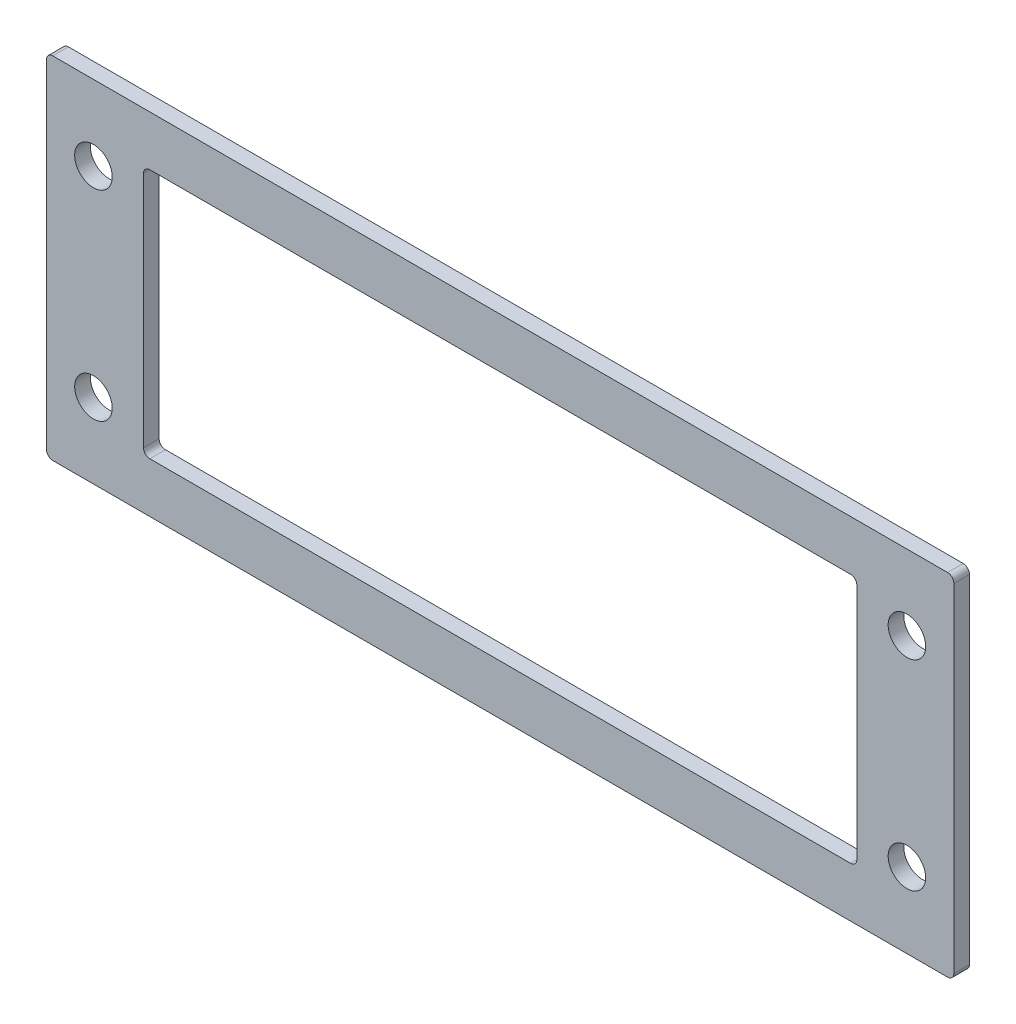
ISO-10303-21;
HEADER;
FILE_DESCRIPTION(('STEP AP214'),'2;1');
FILE_NAME('part.step','',(''),(''),'','','');
FILE_SCHEMA(('AUTOMOTIVE_DESIGN { 1 0 10303 214 1 1 1 1 }'));
ENDSEC;
DATA;
#1=APPLICATION_CONTEXT('core data for automotive mechanical design processes');
#2=APPLICATION_PROTOCOL_DEFINITION('international standard','automotive_design',2000,#1);
#3=PRODUCT_CONTEXT('',#1,'mechanical');
#4=PRODUCT('Part','Part','',(#3));
#5=PRODUCT_RELATED_PRODUCT_CATEGORY('part','',(#4));
#6=PRODUCT_DEFINITION_FORMATION('','',#4);
#7=PRODUCT_DEFINITION_CONTEXT('part definition',#1,'design');
#8=PRODUCT_DEFINITION('design','',#6,#7);
#9=PRODUCT_DEFINITION_SHAPE('','',#8);
#10=(LENGTH_UNIT() NAMED_UNIT(*) SI_UNIT(.MILLI.,.METRE.));
#11=(NAMED_UNIT(*) PLANE_ANGLE_UNIT() SI_UNIT($,.RADIAN.));
#12=(NAMED_UNIT(*) SI_UNIT($,.STERADIAN.) SOLID_ANGLE_UNIT());
#13=UNCERTAINTY_MEASURE_WITH_UNIT(LENGTH_MEASURE(1.E-05),#10,'distance_accuracy_value','');
#14=(GEOMETRIC_REPRESENTATION_CONTEXT(3) GLOBAL_UNCERTAINTY_ASSIGNED_CONTEXT((#13)) GLOBAL_UNIT_ASSIGNED_CONTEXT((#10,
#11,#12)) REPRESENTATION_CONTEXT('',''));
#15=CARTESIAN_POINT('',(0.,0.,0.));
#16=DIRECTION('',(0.,0.,1.));
#17=DIRECTION('',(1.,0.,0.));
#18=AXIS2_PLACEMENT_3D('',#15,#16,#17);
#19=CARTESIAN_POINT('',(-65.,16.,8.56471862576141));
#20=DIRECTION('',(0.,0.,1.));
#21=DIRECTION('',(1.,0.,0.));
#22=AXIS2_PLACEMENT_3D('',#19,#20,#21);
#23=CYLINDRICAL_SURFACE('',#22,3.);
#24=CARTESIAN_POINT('',(-65.,16.,17.05));
#25=DIRECTION('',(0.,0.,1.));
#26=DIRECTION('',(1.,0.,0.));
#27=AXIS2_PLACEMENT_3D('',#24,#25,#26);
#28=CIRCLE('',#27,3.);
#29=CARTESIAN_POINT('',(-62.,16.,17.05));
#30=VERTEX_POINT('',#29);
#31=EDGE_CURVE('E324',#30,#30,#28,.T.);
#32=ORIENTED_EDGE('',*,*,#31,.F.);
#33=EDGE_LOOP('',(#32));
#34=FACE_BOUND('',#33,.T.);
#35=CARTESIAN_POINT('',(-65.,16.,19.55));
#36=DIRECTION('',(0.,0.,-1.));
#37=DIRECTION('',(-1.,0.,0.));
#38=AXIS2_PLACEMENT_3D('',#35,#36,#37);
#39=CIRCLE('',#38,3.);
#40=CARTESIAN_POINT('',(-68.,16.,19.55));
#41=VERTEX_POINT('',#40);
#42=EDGE_CURVE('E35',#41,#41,#39,.T.);
#43=ORIENTED_EDGE('',*,*,#42,.F.);
#44=EDGE_LOOP('',(#43));
#45=FACE_BOUND('',#44,.T.);
#46=ADVANCED_FACE('F15',(#34,#45),#23,.F.);
#47=CARTESIAN_POINT('',(65.,16.,8.56471862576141));
#48=DIRECTION('',(0.,0.,1.));
#49=DIRECTION('',(1.,0.,0.));
#50=AXIS2_PLACEMENT_3D('',#47,#48,#49);
#51=CYLINDRICAL_SURFACE('',#50,3.);
#52=CARTESIAN_POINT('',(65.,16.,17.05));
#53=DIRECTION('',(0.,0.,1.));
#54=DIRECTION('',(1.,0.,0.));
#55=AXIS2_PLACEMENT_3D('',#52,#53,#54);
#56=CIRCLE('',#55,3.);
#57=CARTESIAN_POINT('',(68.,16.,17.05));
#58=VERTEX_POINT('',#57);
#59=EDGE_CURVE('E321',#58,#58,#56,.T.);
#60=ORIENTED_EDGE('',*,*,#59,.F.);
#61=EDGE_LOOP('',(#60));
#62=FACE_BOUND('',#61,.T.);
#63=CARTESIAN_POINT('',(65.,16.,19.55));
#64=DIRECTION('',(0.,0.,-1.));
#65=DIRECTION('',(-1.,0.,0.));
#66=AXIS2_PLACEMENT_3D('',#63,#64,#65);
#67=CIRCLE('',#66,3.);
#68=CARTESIAN_POINT('',(62.,16.,19.55));
#69=VERTEX_POINT('',#68);
#70=EDGE_CURVE('E360',#69,#69,#67,.T.);
#71=ORIENTED_EDGE('',*,*,#70,.F.);
#72=EDGE_LOOP('',(#71));
#73=FACE_BOUND('',#72,.T.);
#74=ADVANCED_FACE('F413',(#62,#73),#51,.F.);
#75=CARTESIAN_POINT('',(-71.5,27.,17.05));
#76=DIRECTION('',(0.,0.,1.));
#77=DIRECTION('',(1.,0.,0.));
#78=AXIS2_PLACEMENT_3D('',#75,#76,#77);
#79=CYLINDRICAL_SURFACE('',#78,1.);
#80=CARTESIAN_POINT('',(-71.5,27.,17.05));
#81=DIRECTION('',(0.,0.,-1.));
#82=DIRECTION('',(1.,0.,0.));
#83=AXIS2_PLACEMENT_3D('',#80,#81,#82);
#84=CIRCLE('',#83,1.);
#85=CARTESIAN_POINT('',(-72.5,27.,17.05));
#86=VERTEX_POINT('',#85);
#87=CARTESIAN_POINT('',(-71.5,28.,17.05));
#88=VERTEX_POINT('',#87);
#89=EDGE_CURVE('E276',#86,#88,#84,.T.);
#90=ORIENTED_EDGE('',*,*,#89,.F.);
#91=DIRECTION('',(0.,0.,-1.));
#92=VECTOR('',#91,1.);
#93=CARTESIAN_POINT('',(-72.5,27.,17.05));
#94=LINE('',#93,#92);
#95=CARTESIAN_POINT('',(-72.5,27.,19.55));
#96=VERTEX_POINT('',#95);
#97=EDGE_CURVE('E241',#96,#86,#94,.T.);
#98=ORIENTED_EDGE('',*,*,#97,.F.);
#99=CARTESIAN_POINT('',(-71.5,27.,19.55));
#100=DIRECTION('',(0.,0.,1.));
#101=DIRECTION('',(1.,0.,0.));
#102=AXIS2_PLACEMENT_3D('',#99,#100,#101);
#103=CIRCLE('',#102,1.);
#104=CARTESIAN_POINT('',(-71.5,28.,19.55));
#105=VERTEX_POINT('',#104);
#106=EDGE_CURVE('E343',#105,#96,#103,.T.);
#107=ORIENTED_EDGE('',*,*,#106,.F.);
#108=DIRECTION('',(0.,0.,1.));
#109=VECTOR('',#108,1.);
#110=CARTESIAN_POINT('',(-71.5,28.,17.05));
#111=LINE('',#110,#109);
#112=EDGE_CURVE('E247',#88,#105,#111,.T.);
#113=ORIENTED_EDGE('',*,*,#112,.F.);
#114=EDGE_LOOP('',(#90,#98,#107,#113));
#115=FACE_BOUND('',#114,.T.);
#116=ADVANCED_FACE('F418',(#115),#79,.T.);
#117=CARTESIAN_POINT('',(-71.5,-27.,17.05));
#118=DIRECTION('',(0.,0.,1.));
#119=DIRECTION('',(1.,0.,0.));
#120=AXIS2_PLACEMENT_3D('',#117,#118,#119);
#121=CYLINDRICAL_SURFACE('',#120,1.);
#122=CARTESIAN_POINT('',(-71.5,-27.,17.05));
#123=DIRECTION('',(0.,0.,-1.));
#124=DIRECTION('',(1.,0.,0.));
#125=AXIS2_PLACEMENT_3D('',#122,#123,#124);
#126=CIRCLE('',#125,1.);
#127=CARTESIAN_POINT('',(-71.5,-28.,17.05));
#128=VERTEX_POINT('',#127);
#129=CARTESIAN_POINT('',(-72.5,-27.,17.05));
#130=VERTEX_POINT('',#129);
#131=EDGE_CURVE('E291',#128,#130,#126,.T.);
#132=ORIENTED_EDGE('',*,*,#131,.F.);
#133=DIRECTION('',(0.,0.,-1.));
#134=VECTOR('',#133,1.);
#135=CARTESIAN_POINT('',(-71.5,-28.,17.05));
#136=LINE('',#135,#134);
#137=CARTESIAN_POINT('',(-71.5,-28.,19.55));
#138=VERTEX_POINT('',#137);
#139=EDGE_CURVE('E235',#138,#128,#136,.T.);
#140=ORIENTED_EDGE('',*,*,#139,.F.);
#141=CARTESIAN_POINT('',(-71.5,-27.,19.55));
#142=DIRECTION('',(0.,0.,1.));
#143=DIRECTION('',(1.,0.,0.));
#144=AXIS2_PLACEMENT_3D('',#141,#142,#143);
#145=CIRCLE('',#144,1.);
#146=CARTESIAN_POINT('',(-72.5,-27.,19.55));
#147=VERTEX_POINT('',#146);
#148=EDGE_CURVE('E348',#147,#138,#145,.T.);
#149=ORIENTED_EDGE('',*,*,#148,.F.);
#150=DIRECTION('',(0.,0.,1.));
#151=VECTOR('',#150,1.);
#152=CARTESIAN_POINT('',(-72.5,-27.,17.05));
#153=LINE('',#152,#151);
#154=EDGE_CURVE('E238',#130,#147,#153,.T.);
#155=ORIENTED_EDGE('',*,*,#154,.F.);
#156=EDGE_LOOP('',(#132,#140,#149,#155));
#157=FACE_BOUND('',#156,.T.);
#158=ADVANCED_FACE('F495',(#157),#121,.T.);
#159=CARTESIAN_POINT('',(71.5,-27.,17.05));
#160=DIRECTION('',(0.,0.,1.));
#161=DIRECTION('',(1.,0.,0.));
#162=AXIS2_PLACEMENT_3D('',#159,#160,#161);
#163=CYLINDRICAL_SURFACE('',#162,1.);
#164=CARTESIAN_POINT('',(71.5,-27.,17.05));
#165=DIRECTION('',(0.,0.,-1.));
#166=DIRECTION('',(1.,0.,0.));
#167=AXIS2_PLACEMENT_3D('',#164,#165,#166);
#168=CIRCLE('',#167,1.);
#169=CARTESIAN_POINT('',(72.5,-27.,17.05));
#170=VERTEX_POINT('',#169);
#171=CARTESIAN_POINT('',(71.5,-28.,17.05));
#172=VERTEX_POINT('',#171);
#173=EDGE_CURVE('E287',#170,#172,#168,.T.);
#174=ORIENTED_EDGE('',*,*,#173,.F.);
#175=DIRECTION('',(0.,0.,-1.));
#176=VECTOR('',#175,1.);
#177=CARTESIAN_POINT('',(72.5,-27.,17.05));
#178=LINE('',#177,#176);
#179=CARTESIAN_POINT('',(72.5,-27.,19.55));
#180=VERTEX_POINT('',#179);
#181=EDGE_CURVE('E229',#180,#170,#178,.T.);
#182=ORIENTED_EDGE('',*,*,#181,.F.);
#183=CARTESIAN_POINT('',(71.5,-27.,19.55));
#184=DIRECTION('',(0.,0.,1.));
#185=DIRECTION('',(1.,0.,0.));
#186=AXIS2_PLACEMENT_3D('',#183,#184,#185);
#187=CIRCLE('',#186,1.);
#188=CARTESIAN_POINT('',(71.5,-28.,19.55));
#189=VERTEX_POINT('',#188);
#190=EDGE_CURVE('E356',#189,#180,#187,.T.);
#191=ORIENTED_EDGE('',*,*,#190,.F.);
#192=DIRECTION('',(0.,0.,1.));
#193=VECTOR('',#192,1.);
#194=CARTESIAN_POINT('',(71.5,-28.,17.05));
#195=LINE('',#194,#193);
#196=EDGE_CURVE('E232',#172,#189,#195,.T.);
#197=ORIENTED_EDGE('',*,*,#196,.F.);
#198=EDGE_LOOP('',(#174,#182,#191,#197));
#199=FACE_BOUND('',#198,.T.);
#200=ADVANCED_FACE('F499',(#199),#163,.T.);
#201=CARTESIAN_POINT('',(71.5,27.,17.05));
#202=DIRECTION('',(0.,0.,1.));
#203=DIRECTION('',(1.,0.,0.));
#204=AXIS2_PLACEMENT_3D('',#201,#202,#203);
#205=CYLINDRICAL_SURFACE('',#204,1.);
#206=CARTESIAN_POINT('',(71.5,27.,17.05));
#207=DIRECTION('',(0.,0.,-1.));
#208=DIRECTION('',(1.,0.,0.));
#209=AXIS2_PLACEMENT_3D('',#206,#207,#208);
#210=CIRCLE('',#209,1.);
#211=CARTESIAN_POINT('',(71.5,28.,17.05));
#212=VERTEX_POINT('',#211);
#213=CARTESIAN_POINT('',(72.5,27.,17.05));
#214=VERTEX_POINT('',#213);
#215=EDGE_CURVE('E456',#212,#214,#210,.T.);
#216=ORIENTED_EDGE('',*,*,#215,.F.);
#217=DIRECTION('',(0.,0.,-1.));
#218=VECTOR('',#217,1.);
#219=CARTESIAN_POINT('',(71.5,28.,17.05));
#220=LINE('',#219,#218);
#221=CARTESIAN_POINT('',(71.5,28.,19.55));
#222=VERTEX_POINT('',#221);
#223=EDGE_CURVE('E244',#222,#212,#220,.T.);
#224=ORIENTED_EDGE('',*,*,#223,.F.);
#225=CARTESIAN_POINT('',(71.5,27.,19.55));
#226=DIRECTION('',(0.,0.,1.));
#227=DIRECTION('',(1.,0.,0.));
#228=AXIS2_PLACEMENT_3D('',#225,#226,#227);
#229=CIRCLE('',#228,1.);
#230=CARTESIAN_POINT('',(72.5,27.,19.55));
#231=VERTEX_POINT('',#230);
#232=EDGE_CURVE('E333',#231,#222,#229,.T.);
#233=ORIENTED_EDGE('',*,*,#232,.F.);
#234=DIRECTION('',(0.,0.,1.));
#235=VECTOR('',#234,1.);
#236=CARTESIAN_POINT('',(72.5,27.,17.05));
#237=LINE('',#236,#235);
#238=EDGE_CURVE('E226',#214,#231,#237,.T.);
#239=ORIENTED_EDGE('',*,*,#238,.F.);
#240=EDGE_LOOP('',(#216,#224,#233,#239));
#241=FACE_BOUND('',#240,.T.);
#242=ADVANCED_FACE('F455',(#241),#205,.T.);
#243=CARTESIAN_POINT('',(56.,-19.,-103.763906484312));
#244=DIRECTION('',(0.,0.,-1.));
#245=DIRECTION('',(-1.,0.,0.));
#246=AXIS2_PLACEMENT_3D('',#243,#244,#245);
#247=CYLINDRICAL_SURFACE('',#246,1.);
#248=CARTESIAN_POINT('',(56.,-19.,17.05));
#249=DIRECTION('',(0.,0.,1.));
#250=DIRECTION('',(1.,0.,0.));
#251=AXIS2_PLACEMENT_3D('',#248,#249,#250);
#252=CIRCLE('',#251,1.);
#253=CARTESIAN_POINT('',(56.,-20.,17.05));
#254=VERTEX_POINT('',#253);
#255=CARTESIAN_POINT('',(57.,-19.,17.05));
#256=VERTEX_POINT('',#255);
#257=EDGE_CURVE('E274',#254,#256,#252,.T.);
#258=ORIENTED_EDGE('',*,*,#257,.F.);
#259=DIRECTION('',(0.,0.,-1.));
#260=VECTOR('',#259,1.);
#261=CARTESIAN_POINT('',(56.,-20.,17.05));
#262=LINE('',#261,#260);
#263=CARTESIAN_POINT('',(56.,-20.,19.55));
#264=VERTEX_POINT('',#263);
#265=EDGE_CURVE('E205',#264,#254,#262,.T.);
#266=ORIENTED_EDGE('',*,*,#265,.F.);
#267=CARTESIAN_POINT('',(56.,-19.,19.55));
#268=DIRECTION('',(0.,0.,-1.));
#269=DIRECTION('',(1.,0.,0.));
#270=AXIS2_PLACEMENT_3D('',#267,#268,#269);
#271=CIRCLE('',#270,1.);
#272=CARTESIAN_POINT('',(57.,-19.,19.55));
#273=VERTEX_POINT('',#272);
#274=EDGE_CURVE('E203',#273,#264,#271,.T.);
#275=ORIENTED_EDGE('',*,*,#274,.F.);
#276=DIRECTION('',(0.,0.,1.));
#277=VECTOR('',#276,1.);
#278=CARTESIAN_POINT('',(57.,-19.,19.55));
#279=LINE('',#278,#277);
#280=EDGE_CURVE('E10',#256,#273,#279,.T.);
#281=ORIENTED_EDGE('',*,*,#280,.F.);
#282=EDGE_LOOP('',(#258,#266,#275,#281));
#283=FACE_BOUND('',#282,.T.);
#284=ADVANCED_FACE('F204',(#283),#247,.F.);
#285=CARTESIAN_POINT('',(56.,19.,-103.763906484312));
#286=DIRECTION('',(0.,0.,-1.));
#287=DIRECTION('',(-1.,0.,0.));
#288=AXIS2_PLACEMENT_3D('',#285,#286,#287);
#289=CYLINDRICAL_SURFACE('',#288,1.);
#290=CARTESIAN_POINT('',(56.,19.,17.05));
#291=DIRECTION('',(0.,0.,1.));
#292=DIRECTION('',(1.,0.,0.));
#293=AXIS2_PLACEMENT_3D('',#290,#291,#292);
#294=CIRCLE('',#293,1.);
#295=CARTESIAN_POINT('',(57.,19.,17.05));
#296=VERTEX_POINT('',#295);
#297=CARTESIAN_POINT('',(56.,20.,17.05));
#298=VERTEX_POINT('',#297);
#299=EDGE_CURVE('E263',#296,#298,#294,.T.);
#300=ORIENTED_EDGE('',*,*,#299,.F.);
#301=DIRECTION('',(0.,0.,-1.));
#302=VECTOR('',#301,1.);
#303=CARTESIAN_POINT('',(57.,19.,17.05));
#304=LINE('',#303,#302);
#305=CARTESIAN_POINT('',(57.,19.,19.55));
#306=VERTEX_POINT('',#305);
#307=EDGE_CURVE('E24',#306,#296,#304,.T.);
#308=ORIENTED_EDGE('',*,*,#307,.F.);
#309=CARTESIAN_POINT('',(56.,19.,19.55));
#310=DIRECTION('',(0.,0.,-1.));
#311=DIRECTION('',(1.,0.,0.));
#312=AXIS2_PLACEMENT_3D('',#309,#310,#311);
#313=CIRCLE('',#312,1.);
#314=CARTESIAN_POINT('',(56.,20.,19.55));
#315=VERTEX_POINT('',#314);
#316=EDGE_CURVE('E215',#315,#306,#313,.T.);
#317=ORIENTED_EDGE('',*,*,#316,.F.);
#318=DIRECTION('',(0.,0.,1.));
#319=VECTOR('',#318,1.);
#320=CARTESIAN_POINT('',(56.,20.,19.55));
#321=LINE('',#320,#319);
#322=EDGE_CURVE('E255',#298,#315,#321,.T.);
#323=ORIENTED_EDGE('',*,*,#322,.F.);
#324=EDGE_LOOP('',(#300,#308,#317,#323));
#325=FACE_BOUND('',#324,.T.);
#326=ADVANCED_FACE('F264',(#325),#289,.F.);
#327=CARTESIAN_POINT('',(-56.,19.,-103.763906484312));
#328=DIRECTION('',(0.,0.,-1.));
#329=DIRECTION('',(-1.,0.,0.));
#330=AXIS2_PLACEMENT_3D('',#327,#328,#329);
#331=CYLINDRICAL_SURFACE('',#330,1.);
#332=CARTESIAN_POINT('',(-56.,19.,17.05));
#333=DIRECTION('',(0.,0.,1.));
#334=DIRECTION('',(1.,0.,0.));
#335=AXIS2_PLACEMENT_3D('',#332,#333,#334);
#336=CIRCLE('',#335,1.);
#337=CARTESIAN_POINT('',(-56.,20.,17.05));
#338=VERTEX_POINT('',#337);
#339=CARTESIAN_POINT('',(-57.,19.,17.05));
#340=VERTEX_POINT('',#339);
#341=EDGE_CURVE('E304',#338,#340,#336,.T.);
#342=ORIENTED_EDGE('',*,*,#341,.F.);
#343=DIRECTION('',(0.,0.,-1.));
#344=VECTOR('',#343,1.);
#345=CARTESIAN_POINT('',(-56.,20.,17.05));
#346=LINE('',#345,#344);
#347=CARTESIAN_POINT('',(-56.,20.,19.55));
#348=VERTEX_POINT('',#347);
#349=EDGE_CURVE('E250',#348,#338,#346,.T.);
#350=ORIENTED_EDGE('',*,*,#349,.F.);
#351=CARTESIAN_POINT('',(-56.,19.,19.55));
#352=DIRECTION('',(0.,0.,-1.));
#353=DIRECTION('',(1.,0.,0.));
#354=AXIS2_PLACEMENT_3D('',#351,#352,#353);
#355=CIRCLE('',#354,1.);
#356=CARTESIAN_POINT('',(-57.,19.,19.55));
#357=VERTEX_POINT('',#356);
#358=EDGE_CURVE('E377',#357,#348,#355,.T.);
#359=ORIENTED_EDGE('',*,*,#358,.F.);
#360=DIRECTION('',(0.,0.,1.));
#361=VECTOR('',#360,1.);
#362=CARTESIAN_POINT('',(-57.,19.,19.55));
#363=LINE('',#362,#361);
#364=EDGE_CURVE('E254',#340,#357,#363,.T.);
#365=ORIENTED_EDGE('',*,*,#364,.F.);
#366=EDGE_LOOP('',(#342,#350,#359,#365));
#367=FACE_BOUND('',#366,.T.);
#368=ADVANCED_FACE('F389',(#367),#331,.F.);
#369=CARTESIAN_POINT('',(-56.,-19.,-103.763906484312));
#370=DIRECTION('',(0.,0.,-1.));
#371=DIRECTION('',(-1.,0.,0.));
#372=AXIS2_PLACEMENT_3D('',#369,#370,#371);
#373=CYLINDRICAL_SURFACE('',#372,1.);
#374=CARTESIAN_POINT('',(-56.,-19.,17.05));
#375=DIRECTION('',(0.,0.,1.));
#376=DIRECTION('',(1.,0.,0.));
#377=AXIS2_PLACEMENT_3D('',#374,#375,#376);
#378=CIRCLE('',#377,1.);
#379=CARTESIAN_POINT('',(-57.,-19.,17.05));
#380=VERTEX_POINT('',#379);
#381=CARTESIAN_POINT('',(-56.,-20.,17.05));
#382=VERTEX_POINT('',#381);
#383=EDGE_CURVE('E292',#380,#382,#378,.T.);
#384=ORIENTED_EDGE('',*,*,#383,.F.);
#385=DIRECTION('',(0.,0.,-1.));
#386=VECTOR('',#385,1.);
#387=CARTESIAN_POINT('',(-57.,-19.,17.05));
#388=LINE('',#387,#386);
#389=CARTESIAN_POINT('',(-57.,-19.,19.55));
#390=VERTEX_POINT('',#389);
#391=EDGE_CURVE('E251',#390,#380,#388,.T.);
#392=ORIENTED_EDGE('',*,*,#391,.F.);
#393=CARTESIAN_POINT('',(-56.,-19.,19.55));
#394=DIRECTION('',(0.,0.,-1.));
#395=DIRECTION('',(1.,0.,0.));
#396=AXIS2_PLACEMENT_3D('',#393,#394,#395);
#397=CIRCLE('',#396,1.);
#398=CARTESIAN_POINT('',(-56.,-20.,19.55));
#399=VERTEX_POINT('',#398);
#400=EDGE_CURVE('E369',#399,#390,#397,.T.);
#401=ORIENTED_EDGE('',*,*,#400,.F.);
#402=DIRECTION('',(0.,0.,1.));
#403=VECTOR('',#402,1.);
#404=CARTESIAN_POINT('',(-56.,-20.,19.55));
#405=LINE('',#404,#403);
#406=EDGE_CURVE('E258',#382,#399,#405,.T.);
#407=ORIENTED_EDGE('',*,*,#406,.F.);
#408=EDGE_LOOP('',(#384,#392,#401,#407));
#409=FACE_BOUND('',#408,.T.);
#410=ADVANCED_FACE('F396',(#409),#373,.F.);
#411=CARTESIAN_POINT('',(-65.,-16.,-103.763906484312));
#412=DIRECTION('',(0.,0.,1.));
#413=DIRECTION('',(1.,0.,0.));
#414=AXIS2_PLACEMENT_3D('',#411,#412,#413);
#415=CYLINDRICAL_SURFACE('',#414,3.);
#416=CARTESIAN_POINT('',(-65.,-16.,17.05));
#417=DIRECTION('',(0.,0.,1.));
#418=DIRECTION('',(1.,0.,0.));
#419=AXIS2_PLACEMENT_3D('',#416,#417,#418);
#420=CIRCLE('',#419,3.);
#421=CARTESIAN_POINT('',(-62.,-16.,17.05));
#422=VERTEX_POINT('',#421);
#423=EDGE_CURVE('E316',#422,#422,#420,.T.);
#424=ORIENTED_EDGE('',*,*,#423,.F.);
#425=EDGE_LOOP('',(#424));
#426=FACE_BOUND('',#425,.T.);
#427=CARTESIAN_POINT('',(-65.,-16.,19.55));
#428=DIRECTION('',(0.,0.,-1.));
#429=DIRECTION('',(-1.,0.,0.));
#430=AXIS2_PLACEMENT_3D('',#427,#428,#429);
#431=CIRCLE('',#430,3.);
#432=CARTESIAN_POINT('',(-68.,-16.,19.55));
#433=VERTEX_POINT('',#432);
#434=EDGE_CURVE('E210',#433,#433,#431,.T.);
#435=ORIENTED_EDGE('',*,*,#434,.F.);
#436=EDGE_LOOP('',(#435));
#437=FACE_BOUND('',#436,.T.);
#438=ADVANCED_FACE('F434',(#426,#437),#415,.F.);
#439=CARTESIAN_POINT('',(65.,-16.,-103.763906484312));
#440=DIRECTION('',(0.,0.,1.));
#441=DIRECTION('',(1.,0.,0.));
#442=AXIS2_PLACEMENT_3D('',#439,#440,#441);
#443=CYLINDRICAL_SURFACE('',#442,3.);
#444=CARTESIAN_POINT('',(65.,-16.,17.05));
#445=DIRECTION('',(0.,0.,1.));
#446=DIRECTION('',(1.,0.,0.));
#447=AXIS2_PLACEMENT_3D('',#444,#445,#446);
#448=CIRCLE('',#447,3.);
#449=CARTESIAN_POINT('',(68.,-16.,17.05));
#450=VERTEX_POINT('',#449);
#451=EDGE_CURVE('E307',#450,#450,#448,.T.);
#452=ORIENTED_EDGE('',*,*,#451,.F.);
#453=EDGE_LOOP('',(#452));
#454=FACE_BOUND('',#453,.T.);
#455=CARTESIAN_POINT('',(65.,-16.,19.55));
#456=DIRECTION('',(0.,0.,-1.));
#457=DIRECTION('',(-1.,0.,0.));
#458=AXIS2_PLACEMENT_3D('',#455,#456,#457);
#459=CIRCLE('',#458,3.);
#460=CARTESIAN_POINT('',(62.,-16.,19.55));
#461=VERTEX_POINT('',#460);
#462=EDGE_CURVE('E363',#461,#461,#459,.T.);
#463=ORIENTED_EDGE('',*,*,#462,.F.);
#464=EDGE_LOOP('',(#463));
#465=FACE_BOUND('',#464,.T.);
#466=ADVANCED_FACE('F408',(#454,#465),#443,.F.);
#467=CARTESIAN_POINT('',(57.,-20.,-103.763906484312));
#468=DIRECTION('',(-1.,0.,0.));
#469=DIRECTION('',(0.,1.,0.));
#470=AXIS2_PLACEMENT_3D('',#467,#468,#469);
#471=PLANE('',#470);
#472=DIRECTION('',(0.,-1.,0.));
#473=VECTOR('',#472,1.);
#474=CARTESIAN_POINT('',(57.,-20.,19.55));
#475=LINE('',#474,#473);
#476=EDGE_CURVE('E195',#306,#273,#475,.T.);
#477=ORIENTED_EDGE('',*,*,#476,.F.);
#478=ORIENTED_EDGE('',*,*,#307,.T.);
#479=DIRECTION('',(0.,1.,0.));
#480=VECTOR('',#479,1.);
#481=CARTESIAN_POINT('',(57.,-20.,17.05));
#482=LINE('',#481,#480);
#483=EDGE_CURVE('E198',#256,#296,#482,.T.);
#484=ORIENTED_EDGE('',*,*,#483,.F.);
#485=ORIENTED_EDGE('',*,*,#280,.T.);
#486=EDGE_LOOP('',(#477,#478,#484,#485));
#487=FACE_BOUND('',#486,.T.);
#488=ADVANCED_FACE('F193',(#487),#471,.T.);
#489=CARTESIAN_POINT('',(57.,-20.,-103.763906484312));
#490=DIRECTION('',(0.,1.,0.));
#491=DIRECTION('',(-1.,0.,0.));
#492=AXIS2_PLACEMENT_3D('',#489,#490,#491);
#493=PLANE('',#492);
#494=DIRECTION('',(1.,0.,0.));
#495=VECTOR('',#494,1.);
#496=CARTESIAN_POINT('',(57.,-20.,17.05));
#497=LINE('',#496,#495);
#498=EDGE_CURVE('E295',#382,#254,#497,.T.);
#499=ORIENTED_EDGE('',*,*,#498,.F.);
#500=ORIENTED_EDGE('',*,*,#406,.T.);
#501=DIRECTION('',(-1.,0.,0.));
#502=VECTOR('',#501,1.);
#503=CARTESIAN_POINT('',(57.,-20.,19.55));
#504=LINE('',#503,#502);
#505=EDGE_CURVE('E366',#264,#399,#504,.T.);
#506=ORIENTED_EDGE('',*,*,#505,.F.);
#507=ORIENTED_EDGE('',*,*,#265,.T.);
#508=EDGE_LOOP('',(#499,#500,#506,#507));
#509=FACE_BOUND('',#508,.T.);
#510=ADVANCED_FACE('F399',(#509),#493,.T.);
#511=CARTESIAN_POINT('',(-57.,-20.,-103.763906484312));
#512=DIRECTION('',(1.,0.,0.));
#513=DIRECTION('',(0.,0.,-1.));
#514=AXIS2_PLACEMENT_3D('',#511,#512,#513);
#515=PLANE('',#514);
#516=DIRECTION('',(0.,1.,0.));
#517=VECTOR('',#516,1.);
#518=CARTESIAN_POINT('',(-57.,-20.,19.55));
#519=LINE('',#518,#517);
#520=EDGE_CURVE('E373',#390,#357,#519,.T.);
#521=ORIENTED_EDGE('',*,*,#520,.F.);
#522=ORIENTED_EDGE('',*,*,#391,.T.);
#523=DIRECTION('',(0.,-1.,0.));
#524=VECTOR('',#523,1.);
#525=CARTESIAN_POINT('',(-57.,-20.,17.05));
#526=LINE('',#525,#524);
#527=EDGE_CURVE('E296',#340,#380,#526,.T.);
#528=ORIENTED_EDGE('',*,*,#527,.F.);
#529=ORIENTED_EDGE('',*,*,#364,.T.);
#530=EDGE_LOOP('',(#521,#522,#528,#529));
#531=FACE_BOUND('',#530,.T.);
#532=ADVANCED_FACE('F392',(#531),#515,.T.);
#533=CARTESIAN_POINT('',(57.,20.,-103.763906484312));
#534=DIRECTION('',(0.,-1.,0.));
#535=DIRECTION('',(0.,0.,1.));
#536=AXIS2_PLACEMENT_3D('',#533,#534,#535);
#537=PLANE('',#536);
#538=DIRECTION('',(1.,0.,0.));
#539=VECTOR('',#538,1.);
#540=CARTESIAN_POINT('',(57.,20.,19.55));
#541=LINE('',#540,#539);
#542=EDGE_CURVE('E220',#348,#315,#541,.T.);
#543=ORIENTED_EDGE('',*,*,#542,.F.);
#544=ORIENTED_EDGE('',*,*,#349,.T.);
#545=DIRECTION('',(-1.,0.,0.));
#546=VECTOR('',#545,1.);
#547=CARTESIAN_POINT('',(57.,20.,17.05));
#548=LINE('',#547,#546);
#549=EDGE_CURVE('E269',#298,#338,#548,.T.);
#550=ORIENTED_EDGE('',*,*,#549,.F.);
#551=ORIENTED_EDGE('',*,*,#322,.T.);
#552=EDGE_LOOP('',(#543,#544,#550,#551));
#553=FACE_BOUND('',#552,.T.);
#554=ADVANCED_FACE('F385',(#553),#537,.T.);
#555=CARTESIAN_POINT('',(72.5,28.,17.05));
#556=DIRECTION('',(0.,-1.,0.));
#557=DIRECTION('',(0.,0.,1.));
#558=AXIS2_PLACEMENT_3D('',#555,#556,#557);
#559=PLANE('',#558);
#560=DIRECTION('',(1.,0.,0.));
#561=VECTOR('',#560,1.);
#562=CARTESIAN_POINT('',(72.5,28.,19.55));
#563=LINE('',#562,#561);
#564=EDGE_CURVE('E337',#105,#222,#563,.T.);
#565=ORIENTED_EDGE('',*,*,#564,.T.);
#566=ORIENTED_EDGE('',*,*,#223,.T.);
#567=DIRECTION('',(1.,0.,0.));
#568=VECTOR('',#567,1.);
#569=CARTESIAN_POINT('',(72.5,28.,17.05));
#570=LINE('',#569,#568);
#571=EDGE_CURVE('E484',#88,#212,#570,.T.);
#572=ORIENTED_EDGE('',*,*,#571,.F.);
#573=ORIENTED_EDGE('',*,*,#112,.T.);
#574=EDGE_LOOP('',(#565,#566,#572,#573));
#575=FACE_BOUND('',#574,.T.);
#576=ADVANCED_FACE('F460',(#575),#559,.F.);
#577=CARTESIAN_POINT('',(-72.5,-28.,17.05));
#578=DIRECTION('',(1.,0.,0.));
#579=DIRECTION('',(0.,0.,-1.));
#580=AXIS2_PLACEMENT_3D('',#577,#578,#579);
#581=PLANE('',#580);
#582=DIRECTION('',(0.,1.,0.));
#583=VECTOR('',#582,1.);
#584=CARTESIAN_POINT('',(-72.5,-28.,17.05));
#585=LINE('',#584,#583);
#586=EDGE_CURVE('E283',#130,#86,#585,.T.);
#587=ORIENTED_EDGE('',*,*,#586,.F.);
#588=ORIENTED_EDGE('',*,*,#154,.T.);
#589=DIRECTION('',(0.,1.,0.));
#590=VECTOR('',#589,1.);
#591=CARTESIAN_POINT('',(-72.5,-28.,19.55));
#592=LINE('',#591,#590);
#593=EDGE_CURVE('E347',#147,#96,#592,.T.);
#594=ORIENTED_EDGE('',*,*,#593,.T.);
#595=ORIENTED_EDGE('',*,*,#97,.T.);
#596=EDGE_LOOP('',(#587,#588,#594,#595));
#597=FACE_BOUND('',#596,.T.);
#598=ADVANCED_FACE('F470',(#597),#581,.F.);
#599=CARTESIAN_POINT('',(72.5,-28.,17.05));
#600=DIRECTION('',(0.,1.,0.));
#601=DIRECTION('',(-1.,0.,0.));
#602=AXIS2_PLACEMENT_3D('',#599,#600,#601);
#603=PLANE('',#602);
#604=DIRECTION('',(-1.,0.,0.));
#605=VECTOR('',#604,1.);
#606=CARTESIAN_POINT('',(72.5,-28.,17.05));
#607=LINE('',#606,#605);
#608=EDGE_CURVE('E288',#172,#128,#607,.T.);
#609=ORIENTED_EDGE('',*,*,#608,.F.);
#610=ORIENTED_EDGE('',*,*,#196,.T.);
#611=DIRECTION('',(-1.,0.,0.));
#612=VECTOR('',#611,1.);
#613=CARTESIAN_POINT('',(72.5,-28.,19.55));
#614=LINE('',#613,#612);
#615=EDGE_CURVE('E352',#189,#138,#614,.T.);
#616=ORIENTED_EDGE('',*,*,#615,.T.);
#617=ORIENTED_EDGE('',*,*,#139,.T.);
#618=EDGE_LOOP('',(#609,#610,#616,#617));
#619=FACE_BOUND('',#618,.T.);
#620=ADVANCED_FACE('F497',(#619),#603,.F.);
#621=CARTESIAN_POINT('',(72.5,-28.,17.05));
#622=DIRECTION('',(-1.,0.,0.));
#623=DIRECTION('',(0.,1.,0.));
#624=AXIS2_PLACEMENT_3D('',#621,#622,#623);
#625=PLANE('',#624);
#626=DIRECTION('',(0.,-1.,0.));
#627=VECTOR('',#626,1.);
#628=CARTESIAN_POINT('',(72.5,-28.,17.05));
#629=LINE('',#628,#627);
#630=EDGE_CURVE('E451',#214,#170,#629,.T.);
#631=ORIENTED_EDGE('',*,*,#630,.F.);
#632=ORIENTED_EDGE('',*,*,#238,.T.);
#633=DIRECTION('',(0.,-1.,0.));
#634=VECTOR('',#633,1.);
#635=CARTESIAN_POINT('',(72.5,-28.,19.55));
#636=LINE('',#635,#634);
#637=EDGE_CURVE('E327',#231,#180,#636,.T.);
#638=ORIENTED_EDGE('',*,*,#637,.T.);
#639=ORIENTED_EDGE('',*,*,#181,.T.);
#640=EDGE_LOOP('',(#631,#632,#638,#639));
#641=FACE_BOUND('',#640,.T.);
#642=ADVANCED_FACE('F438',(#641),#625,.F.);
#643=CARTESIAN_POINT('',(72.5,28.,19.55));
#644=DIRECTION('',(0.,0.,1.));
#645=DIRECTION('',(0.,-1.,0.));
#646=AXIS2_PLACEMENT_3D('',#643,#644,#645);
#647=PLANE('',#646);
#648=ORIENTED_EDGE('',*,*,#42,.T.);
#649=EDGE_LOOP('',(#648));
#650=FACE_BOUND('',#649,.T.);
#651=ORIENTED_EDGE('',*,*,#434,.T.);
#652=EDGE_LOOP('',(#651));
#653=FACE_BOUND('',#652,.T.);
#654=ORIENTED_EDGE('',*,*,#505,.T.);
#655=ORIENTED_EDGE('',*,*,#400,.T.);
#656=ORIENTED_EDGE('',*,*,#520,.T.);
#657=ORIENTED_EDGE('',*,*,#358,.T.);
#658=ORIENTED_EDGE('',*,*,#542,.T.);
#659=ORIENTED_EDGE('',*,*,#316,.T.);
#660=ORIENTED_EDGE('',*,*,#476,.T.);
#661=ORIENTED_EDGE('',*,*,#274,.T.);
#662=EDGE_LOOP('',(#654,#655,#656,#657,#658,#659,#660,#661));
#663=FACE_BOUND('',#662,.T.);
#664=ORIENTED_EDGE('',*,*,#462,.T.);
#665=EDGE_LOOP('',(#664));
#666=FACE_BOUND('',#665,.T.);
#667=ORIENTED_EDGE('',*,*,#70,.T.);
#668=EDGE_LOOP('',(#667));
#669=FACE_BOUND('',#668,.T.);
#670=ORIENTED_EDGE('',*,*,#637,.F.);
#671=ORIENTED_EDGE('',*,*,#232,.T.);
#672=ORIENTED_EDGE('',*,*,#564,.F.);
#673=ORIENTED_EDGE('',*,*,#106,.T.);
#674=ORIENTED_EDGE('',*,*,#593,.F.);
#675=ORIENTED_EDGE('',*,*,#148,.T.);
#676=ORIENTED_EDGE('',*,*,#615,.F.);
#677=ORIENTED_EDGE('',*,*,#190,.T.);
#678=EDGE_LOOP('',(#670,#671,#672,#673,#674,#675,#676,#677));
#679=FACE_BOUND('',#678,.T.);
#680=ADVANCED_FACE('F212',(#650,#653,#663,#666,#669,#679),#647,.T.);
#681=CARTESIAN_POINT('',(72.5,28.,17.05));
#682=DIRECTION('',(0.,0.,1.));
#683=DIRECTION('',(0.,-1.,0.));
#684=AXIS2_PLACEMENT_3D('',#681,#682,#683);
#685=PLANE('',#684);
#686=ORIENTED_EDGE('',*,*,#31,.T.);
#687=EDGE_LOOP('',(#686));
#688=FACE_BOUND('',#687,.T.);
#689=ORIENTED_EDGE('',*,*,#59,.T.);
#690=EDGE_LOOP('',(#689));
#691=FACE_BOUND('',#690,.T.);
#692=ORIENTED_EDGE('',*,*,#423,.T.);
#693=EDGE_LOOP('',(#692));
#694=FACE_BOUND('',#693,.T.);
#695=ORIENTED_EDGE('',*,*,#451,.T.);
#696=EDGE_LOOP('',(#695));
#697=FACE_BOUND('',#696,.T.);
#698=ORIENTED_EDGE('',*,*,#483,.T.);
#699=ORIENTED_EDGE('',*,*,#299,.T.);
#700=ORIENTED_EDGE('',*,*,#549,.T.);
#701=ORIENTED_EDGE('',*,*,#341,.T.);
#702=ORIENTED_EDGE('',*,*,#527,.T.);
#703=ORIENTED_EDGE('',*,*,#383,.T.);
#704=ORIENTED_EDGE('',*,*,#498,.T.);
#705=ORIENTED_EDGE('',*,*,#257,.T.);
#706=EDGE_LOOP('',(#698,#699,#700,#701,#702,#703,#704,#705));
#707=FACE_BOUND('',#706,.T.);
#708=ORIENTED_EDGE('',*,*,#571,.T.);
#709=ORIENTED_EDGE('',*,*,#215,.T.);
#710=ORIENTED_EDGE('',*,*,#630,.T.);
#711=ORIENTED_EDGE('',*,*,#173,.T.);
#712=ORIENTED_EDGE('',*,*,#608,.T.);
#713=ORIENTED_EDGE('',*,*,#131,.T.);
#714=ORIENTED_EDGE('',*,*,#586,.T.);
#715=ORIENTED_EDGE('',*,*,#89,.T.);
#716=EDGE_LOOP('',(#708,#709,#710,#711,#712,#713,#714,#715));
#717=FACE_BOUND('',#716,.T.);
#718=ADVANCED_FACE('F271',(#688,#691,#694,#697,#707,#717),#685,.F.);
#719=CLOSED_SHELL('',(#46,#74,#116,#158,#200,#242,#284,#326,#368,#410,#438,#466,#488,#510,#532,
#554,#576,#598,#620,#642,#680,#718));
#720=MANIFOLD_SOLID_BREP('B1',#719);
#721=ADVANCED_BREP_SHAPE_REPRESENTATION('',(#18,#720),#14);
#722=SHAPE_DEFINITION_REPRESENTATION(#9,#721);
ENDSEC;
END-ISO-10303-21;
